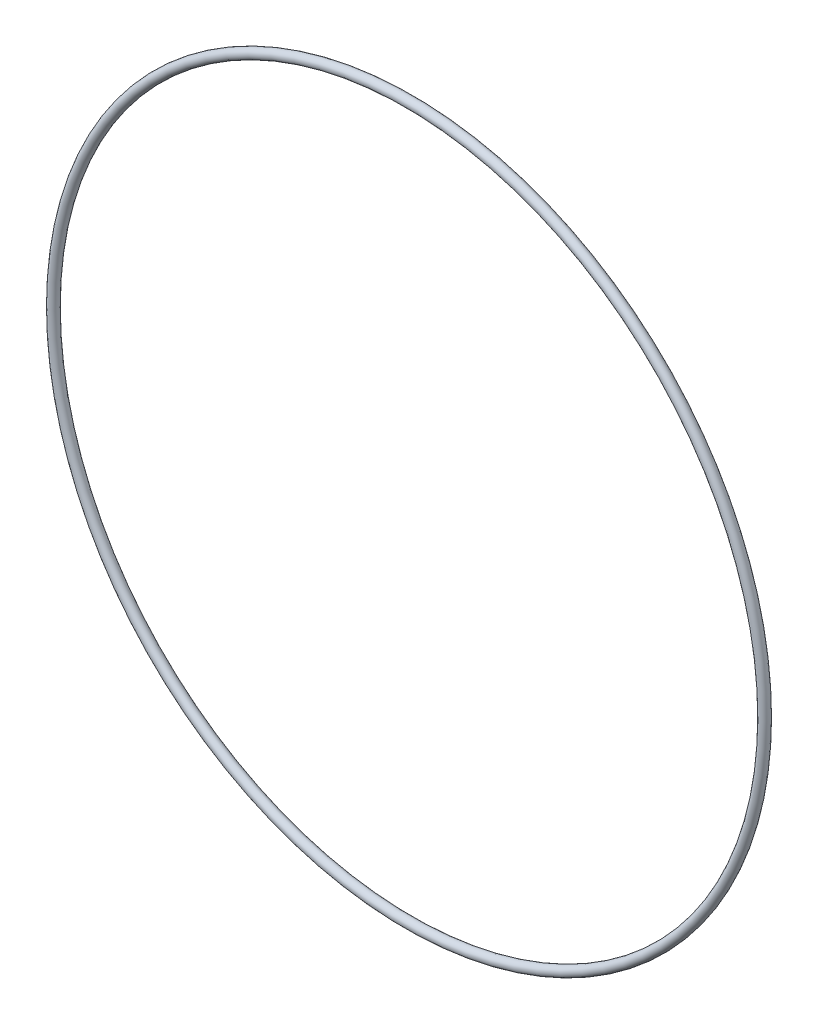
from build123d import *

# Parameters (mm, degrees)
SKETCH1_R = 1.7653


with BuildPart() as part:
    # Sketch1 → Revolve1 (revolve)
    with BuildSketch(Plane(origin=(0, 0, 0), x_dir=(0, -1, 0), z_dir=(1, 0, 0)), mode=Mode.PRIVATE) as revolve1_sk:
        with Locations((128.5621, 0)):
            Circle(SKETCH1_R)
    revolve(revolve1_sk.sketch.rotate(Axis((0, 0, 1.7653), (0, 0, -1)), 270), axis=Axis((0, 0, 1.7653), (0, 0, -1)))


solid = part.part
